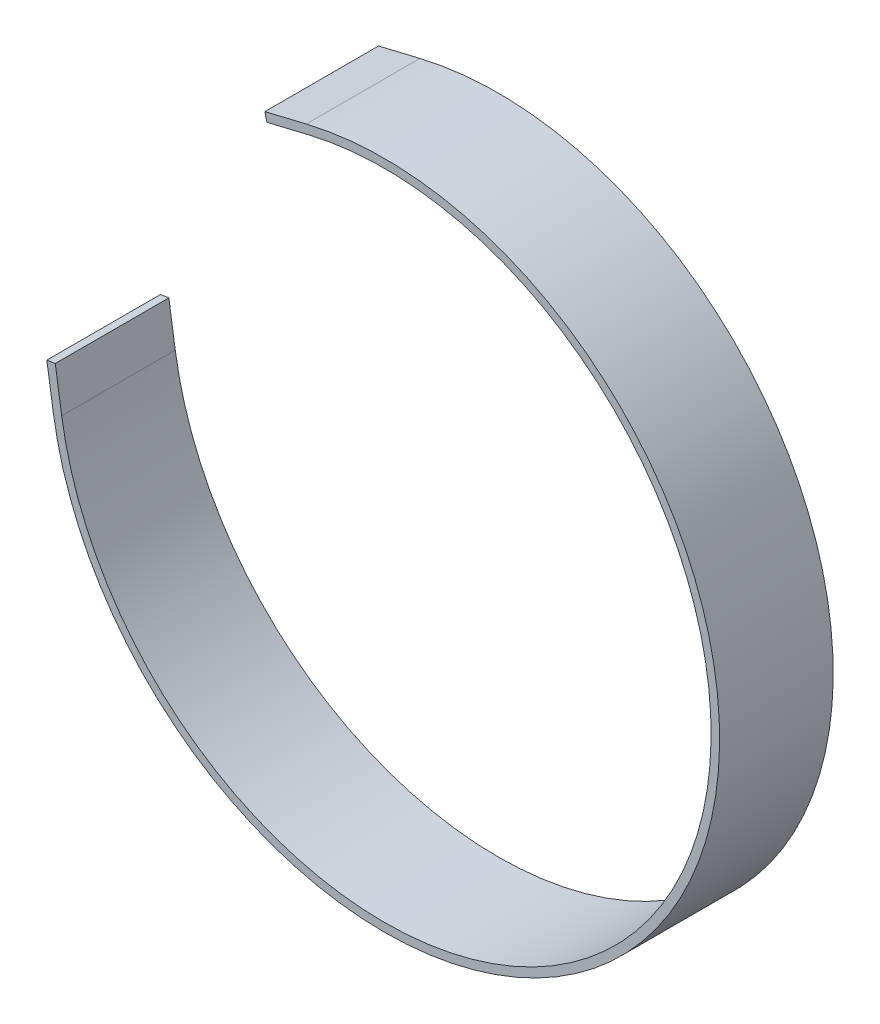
from build123d import *

# Parameters (mm, degrees)
EXTRUSION1_DEPTH = 80


with BuildPart() as part:
    # Esquisse1 → Extrusion1 (new body)
    with BuildSketch(Plane.XY):
        with BuildLine():
            Line((-233.309422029, -35.534681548), (-237.826542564, -5.876704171))
            Line((-237.826542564, -5.876704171), (-231.894947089, -4.973280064))
            Line((-231.894947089, -4.973280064), (-227.377826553, -34.63125744))
            ThreePointArc((-227.377826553, -34.63125744), (190.858035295, -128.348004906), (-53.692433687, 223.645081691))
            Line((-53.692433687, 223.645081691), (-82.863531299, 216.641720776))
            Line((-82.863531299, 216.641720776), (-84.264203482, 222.475940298))
            Line((-84.264203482, 222.475940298), (-55.09310587, 229.479301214))
            ThreePointArc((-55.09310587, 229.479301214), (195.836940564, -131.696213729), (-233.309422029, -35.534681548))
        make_face()
    extrude(amount=EXTRUSION1_DEPTH)


solid = part.part
